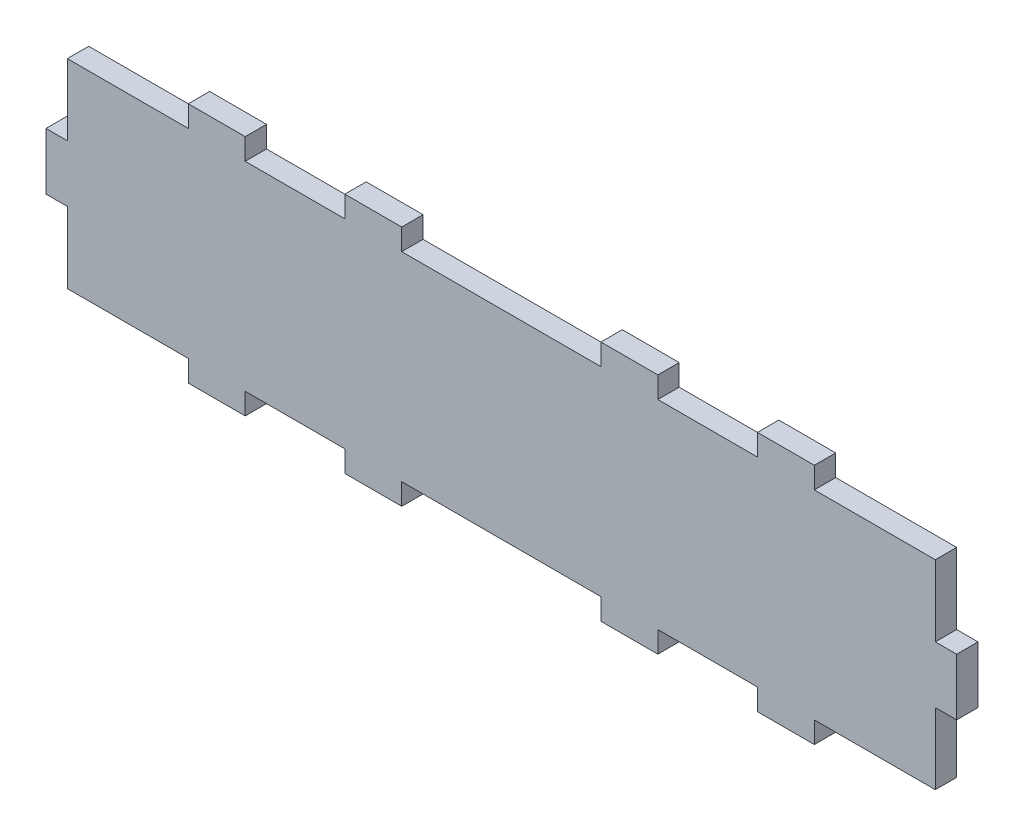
ISO-10303-21;
HEADER;
FILE_DESCRIPTION(('STEP AP214'),'2;1');
FILE_NAME('part.step','',(''),(''),'','','');
FILE_SCHEMA(('AUTOMOTIVE_DESIGN { 1 0 10303 214 1 1 1 1 }'));
ENDSEC;
DATA;
#1=APPLICATION_CONTEXT('core data for automotive mechanical design processes');
#2=APPLICATION_PROTOCOL_DEFINITION('international standard','automotive_design',2000,#1);
#3=PRODUCT_CONTEXT('',#1,'mechanical');
#4=PRODUCT('Part','Part','',(#3));
#5=PRODUCT_RELATED_PRODUCT_CATEGORY('part','',(#4));
#6=PRODUCT_DEFINITION_FORMATION('','',#4);
#7=PRODUCT_DEFINITION_CONTEXT('part definition',#1,'design');
#8=PRODUCT_DEFINITION('design','',#6,#7);
#9=PRODUCT_DEFINITION_SHAPE('','',#8);
#10=(LENGTH_UNIT() NAMED_UNIT(*) SI_UNIT(.MILLI.,.METRE.));
#11=(NAMED_UNIT(*) PLANE_ANGLE_UNIT() SI_UNIT($,.RADIAN.));
#12=(NAMED_UNIT(*) SI_UNIT($,.STERADIAN.) SOLID_ANGLE_UNIT());
#13=UNCERTAINTY_MEASURE_WITH_UNIT(LENGTH_MEASURE(1.E-05),#10,'distance_accuracy_value','');
#14=(GEOMETRIC_REPRESENTATION_CONTEXT(3) GLOBAL_UNCERTAINTY_ASSIGNED_CONTEXT((#13)) GLOBAL_UNIT_ASSIGNED_CONTEXT((#10,
#11,#12)) REPRESENTATION_CONTEXT('',''));
#15=CARTESIAN_POINT('',(0.,0.,0.));
#16=DIRECTION('',(0.,0.,1.));
#17=DIRECTION('',(1.,0.,0.));
#18=AXIS2_PLACEMENT_3D('',#15,#16,#17);
#19=CARTESIAN_POINT('',(0.,140.,15.));
#20=DIRECTION('',(0.,-1.,0.));
#21=DIRECTION('',(0.,0.,-1.));
#22=AXIS2_PLACEMENT_3D('',#19,#20,#21);
#23=PLANE('',#22);
#24=DIRECTION('',(0.,0.,1.));
#25=VECTOR('',#24,1.);
#26=CARTESIAN_POINT('',(85.,140.,15.));
#27=LINE('',#26,#25);
#28=CARTESIAN_POINT('',(85.,140.,0.));
#29=VERTEX_POINT('',#28);
#30=CARTESIAN_POINT('',(85.,140.,15.));
#31=VERTEX_POINT('',#30);
#32=EDGE_CURVE('E750',#29,#31,#27,.T.);
#33=ORIENTED_EDGE('',*,*,#32,.F.);
#34=DIRECTION('',(-1.,0.,0.));
#35=VECTOR('',#34,1.);
#36=CARTESIAN_POINT('',(0.,140.,0.));
#37=LINE('',#36,#35);
#38=CARTESIAN_POINT('',(0.,140.,0.));
#39=VERTEX_POINT('',#38);
#40=EDGE_CURVE('E351',#29,#39,#37,.T.);
#41=ORIENTED_EDGE('',*,*,#40,.T.);
#42=DIRECTION('',(0.,0.,-1.));
#43=VECTOR('',#42,1.);
#44=CARTESIAN_POINT('',(0.,140.,15.));
#45=LINE('',#44,#43);
#46=CARTESIAN_POINT('',(0.,140.,15.));
#47=VERTEX_POINT('',#46);
#48=EDGE_CURVE('E625',#47,#39,#45,.T.);
#49=ORIENTED_EDGE('',*,*,#48,.F.);
#50=DIRECTION('',(-1.,0.,0.));
#51=VECTOR('',#50,1.);
#52=CARTESIAN_POINT('',(0.,140.,15.));
#53=LINE('',#52,#51);
#54=EDGE_CURVE('E62',#31,#47,#53,.T.);
#55=ORIENTED_EDGE('',*,*,#54,.F.);
#56=EDGE_LOOP('',(#33,#41,#49,#55));
#57=FACE_BOUND('',#56,.T.);
#58=ADVANCED_FACE('F47',(#57),#23,.F.);
#59=DIRECTION('',(0.,0.,-1.));
#60=VECTOR('',#59,1.);
#61=CARTESIAN_POINT('',(125.,140.,15.));
#62=LINE('',#61,#60);
#63=CARTESIAN_POINT('',(125.,140.,15.));
#64=VERTEX_POINT('',#63);
#65=CARTESIAN_POINT('',(125.,140.,0.));
#66=VERTEX_POINT('',#65);
#67=EDGE_CURVE('E70',#64,#66,#62,.T.);
#68=ORIENTED_EDGE('',*,*,#67,.F.);
#69=CARTESIAN_POINT('',(195.,140.,15.));
#70=VERTEX_POINT('',#69);
#71=EDGE_CURVE('E759',#70,#64,#53,.T.);
#72=ORIENTED_EDGE('',*,*,#71,.F.);
#73=DIRECTION('',(0.,0.,1.));
#74=VECTOR('',#73,1.);
#75=CARTESIAN_POINT('',(195.,140.,15.));
#76=LINE('',#75,#74);
#77=CARTESIAN_POINT('',(195.,140.,0.));
#78=VERTEX_POINT('',#77);
#79=EDGE_CURVE('E352',#78,#70,#76,.T.);
#80=ORIENTED_EDGE('',*,*,#79,.F.);
#81=EDGE_CURVE('E747',#78,#66,#37,.T.);
#82=ORIENTED_EDGE('',*,*,#81,.T.);
#83=EDGE_LOOP('',(#68,#72,#80,#82));
#84=FACE_BOUND('',#83,.T.);
#85=ADVANCED_FACE('F721',(#84),#23,.F.);
#86=DIRECTION('',(0.,0.,-1.));
#87=VECTOR('',#86,1.);
#88=CARTESIAN_POINT('',(235.,140.,15.));
#89=LINE('',#88,#87);
#90=CARTESIAN_POINT('',(235.,140.,15.));
#91=VERTEX_POINT('',#90);
#92=CARTESIAN_POINT('',(235.,140.,0.));
#93=VERTEX_POINT('',#92);
#94=EDGE_CURVE('E355',#91,#93,#89,.T.);
#95=ORIENTED_EDGE('',*,*,#94,.F.);
#96=CARTESIAN_POINT('',(375.,140.,14.9999999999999));
#97=VERTEX_POINT('',#96);
#98=EDGE_CURVE('E627',#97,#91,#53,.T.);
#99=ORIENTED_EDGE('',*,*,#98,.F.);
#100=DIRECTION('',(0.,0.,1.));
#101=VECTOR('',#100,1.);
#102=CARTESIAN_POINT('',(375.,140.,15.));
#103=LINE('',#102,#101);
#104=CARTESIAN_POINT('',(375.,140.,0.));
#105=VERTEX_POINT('',#104);
#106=EDGE_CURVE('E411',#105,#97,#103,.T.);
#107=ORIENTED_EDGE('',*,*,#106,.F.);
#108=EDGE_CURVE('E642',#105,#93,#37,.T.);
#109=ORIENTED_EDGE('',*,*,#108,.T.);
#110=EDGE_LOOP('',(#95,#99,#107,#109));
#111=FACE_BOUND('',#110,.T.);
#112=ADVANCED_FACE('F727',(#111),#23,.F.);
#113=DIRECTION('',(0.,0.,1.));
#114=VECTOR('',#113,1.);
#115=CARTESIAN_POINT('',(485.,140.,15.));
#116=LINE('',#115,#114);
#117=CARTESIAN_POINT('',(485.,140.,0.));
#118=VERTEX_POINT('',#117);
#119=CARTESIAN_POINT('',(485.,140.,15.));
#120=VERTEX_POINT('',#119);
#121=EDGE_CURVE('E384',#118,#120,#116,.T.);
#122=ORIENTED_EDGE('',*,*,#121,.F.);
#123=CARTESIAN_POINT('',(415.,140.,0.));
#124=VERTEX_POINT('',#123);
#125=EDGE_CURVE('E641',#118,#124,#37,.T.);
#126=ORIENTED_EDGE('',*,*,#125,.T.);
#127=DIRECTION('',(0.,0.,-1.));
#128=VECTOR('',#127,1.);
#129=CARTESIAN_POINT('',(415.,140.,15.));
#130=LINE('',#129,#128);
#131=CARTESIAN_POINT('',(415.,140.,15.));
#132=VERTEX_POINT('',#131);
#133=EDGE_CURVE('E416',#132,#124,#130,.T.);
#134=ORIENTED_EDGE('',*,*,#133,.F.);
#135=EDGE_CURVE('E626',#120,#132,#53,.T.);
#136=ORIENTED_EDGE('',*,*,#135,.F.);
#137=EDGE_LOOP('',(#122,#126,#134,#136));
#138=FACE_BOUND('',#137,.T.);
#139=ADVANCED_FACE('F723',(#138),#23,.F.);
#140=DIRECTION('',(0.,0.,-1.));
#141=VECTOR('',#140,1.);
#142=CARTESIAN_POINT('',(525.,140.,15.0000000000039));
#143=LINE('',#142,#141);
#144=CARTESIAN_POINT('',(525.,140.,15.));
#145=VERTEX_POINT('',#144);
#146=CARTESIAN_POINT('',(525.,140.,0.));
#147=VERTEX_POINT('',#146);
#148=EDGE_CURVE('E389',#145,#147,#143,.T.);
#149=ORIENTED_EDGE('',*,*,#148,.F.);
#150=CARTESIAN_POINT('',(610.,140.,15.));
#151=VERTEX_POINT('',#150);
#152=EDGE_CURVE('E622',#151,#145,#53,.T.);
#153=ORIENTED_EDGE('',*,*,#152,.F.);
#154=DIRECTION('',(0.,0.,-1.));
#155=VECTOR('',#154,1.);
#156=CARTESIAN_POINT('',(610.,140.,15.));
#157=LINE('',#156,#155);
#158=CARTESIAN_POINT('',(610.,140.,0.));
#159=VERTEX_POINT('',#158);
#160=EDGE_CURVE('E645',#151,#159,#157,.T.);
#161=ORIENTED_EDGE('',*,*,#160,.T.);
#162=EDGE_CURVE('E639',#159,#147,#37,.T.);
#163=ORIENTED_EDGE('',*,*,#162,.T.);
#164=EDGE_LOOP('',(#149,#153,#161,#163));
#165=FACE_BOUND('',#164,.T.);
#166=ADVANCED_FACE('F730',(#165),#23,.F.);
#167=CARTESIAN_POINT('',(610.,0.,15.));
#168=DIRECTION('',(-1.,0.,0.));
#169=DIRECTION('',(0.,0.,1.));
#170=AXIS2_PLACEMENT_3D('',#167,#168,#169);
#171=PLANE('',#170);
#172=DIRECTION('',(0.,0.,-1.));
#173=VECTOR('',#172,1.);
#174=CARTESIAN_POINT('',(610.,50.,15.));
#175=LINE('',#174,#173);
#176=CARTESIAN_POINT('',(610.,50.,15.));
#177=VERTEX_POINT('',#176);
#178=CARTESIAN_POINT('',(610.,50.,0.));
#179=VERTEX_POINT('',#178);
#180=EDGE_CURVE('E443',#177,#179,#175,.T.);
#181=ORIENTED_EDGE('',*,*,#180,.F.);
#182=DIRECTION('',(0.,1.,0.));
#183=VECTOR('',#182,1.);
#184=CARTESIAN_POINT('',(610.,0.,15.));
#185=LINE('',#184,#183);
#186=CARTESIAN_POINT('',(610.,0.,15.));
#187=VERTEX_POINT('',#186);
#188=EDGE_CURVE('E619',#187,#177,#185,.T.);
#189=ORIENTED_EDGE('',*,*,#188,.F.);
#190=DIRECTION('',(0.,0.,-1.));
#191=VECTOR('',#190,1.);
#192=CARTESIAN_POINT('',(610.,0.,15.));
#193=LINE('',#192,#191);
#194=CARTESIAN_POINT('',(610.,0.,0.));
#195=VERTEX_POINT('',#194);
#196=EDGE_CURVE('E55',#187,#195,#193,.T.);
#197=ORIENTED_EDGE('',*,*,#196,.T.);
#198=DIRECTION('',(0.,1.,0.));
#199=VECTOR('',#198,1.);
#200=CARTESIAN_POINT('',(610.,0.,0.));
#201=LINE('',#200,#199);
#202=EDGE_CURVE('E637',#195,#179,#201,.T.);
#203=ORIENTED_EDGE('',*,*,#202,.T.);
#204=EDGE_LOOP('',(#181,#189,#197,#203));
#205=FACE_BOUND('',#204,.T.);
#206=ADVANCED_FACE('F652',(#205),#171,.F.);
#207=DIRECTION('',(0.,0.,1.));
#208=VECTOR('',#207,1.);
#209=CARTESIAN_POINT('',(610.,90.,14.9999999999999));
#210=LINE('',#209,#208);
#211=CARTESIAN_POINT('',(610.,90.,0.));
#212=VERTEX_POINT('',#211);
#213=CARTESIAN_POINT('',(610.,90.,15.));
#214=VERTEX_POINT('',#213);
#215=EDGE_CURVE('E438',#212,#214,#210,.T.);
#216=ORIENTED_EDGE('',*,*,#215,.F.);
#217=EDGE_CURVE('E634',#212,#159,#201,.T.);
#218=ORIENTED_EDGE('',*,*,#217,.T.);
#219=ORIENTED_EDGE('',*,*,#160,.F.);
#220=EDGE_CURVE('E616',#214,#151,#185,.T.);
#221=ORIENTED_EDGE('',*,*,#220,.F.);
#222=EDGE_LOOP('',(#216,#218,#219,#221));
#223=FACE_BOUND('',#222,.T.);
#224=ADVANCED_FACE('F1148',(#223),#171,.F.);
#225=CARTESIAN_POINT('',(0.,0.,15.));
#226=DIRECTION('',(1.,0.,0.));
#227=DIRECTION('',(0.,0.,-1.));
#228=AXIS2_PLACEMENT_3D('',#225,#226,#227);
#229=PLANE('',#228);
#230=DIRECTION('',(0.,-1.,0.));
#231=VECTOR('',#230,1.);
#232=CARTESIAN_POINT('',(0.,0.,0.));
#233=LINE('',#232,#231);
#234=CARTESIAN_POINT('',(0.,90.,0.));
#235=VERTEX_POINT('',#234);
#236=EDGE_CURVE('E628',#39,#235,#233,.T.);
#237=ORIENTED_EDGE('',*,*,#236,.T.);
#238=DIRECTION('',(0.,0.,1.));
#239=VECTOR('',#238,1.);
#240=CARTESIAN_POINT('',(0.,90.,15.));
#241=LINE('',#240,#239);
#242=CARTESIAN_POINT('',(0.,90.,15.));
#243=VERTEX_POINT('',#242);
#244=EDGE_CURVE('E465',#235,#243,#241,.T.);
#245=ORIENTED_EDGE('',*,*,#244,.T.);
#246=DIRECTION('',(0.,-1.,0.));
#247=VECTOR('',#246,1.);
#248=CARTESIAN_POINT('',(0.,0.,15.));
#249=LINE('',#248,#247);
#250=EDGE_CURVE('E608',#47,#243,#249,.T.);
#251=ORIENTED_EDGE('',*,*,#250,.F.);
#252=ORIENTED_EDGE('',*,*,#48,.T.);
#253=EDGE_LOOP('',(#237,#245,#251,#252));
#254=FACE_BOUND('',#253,.T.);
#255=ADVANCED_FACE('F752',(#254),#229,.F.);
#256=CARTESIAN_POINT('',(0.,0.,15.));
#257=DIRECTION('',(0.,1.,0.));
#258=DIRECTION('',(0.,0.,1.));
#259=AXIS2_PLACEMENT_3D('',#256,#257,#258);
#260=PLANE('',#259);
#261=DIRECTION('',(1.,0.,0.));
#262=VECTOR('',#261,1.);
#263=CARTESIAN_POINT('',(0.,0.,0.));
#264=LINE('',#263,#262);
#265=CARTESIAN_POINT('',(0.,0.,0.));
#266=VERTEX_POINT('',#265);
#267=CARTESIAN_POINT('',(85.,0.,0.));
#268=VERTEX_POINT('',#267);
#269=EDGE_CURVE('E632',#266,#268,#264,.T.);
#270=ORIENTED_EDGE('',*,*,#269,.T.);
#271=DIRECTION('',(0.,0.,1.));
#272=VECTOR('',#271,1.);
#273=CARTESIAN_POINT('',(85.,0.,0.));
#274=LINE('',#273,#272);
#275=CARTESIAN_POINT('',(85.,0.,15.));
#276=VERTEX_POINT('',#275);
#277=EDGE_CURVE('E507',#268,#276,#274,.T.);
#278=ORIENTED_EDGE('',*,*,#277,.T.);
#279=DIRECTION('',(1.,0.,0.));
#280=VECTOR('',#279,1.);
#281=CARTESIAN_POINT('',(0.,0.,15.));
#282=LINE('',#281,#280);
#283=CARTESIAN_POINT('',(0.,0.,15.));
#284=VERTEX_POINT('',#283);
#285=EDGE_CURVE('E613',#284,#276,#282,.T.);
#286=ORIENTED_EDGE('',*,*,#285,.F.);
#287=DIRECTION('',(0.,0.,-1.));
#288=VECTOR('',#287,1.);
#289=CARTESIAN_POINT('',(0.,0.,15.));
#290=LINE('',#289,#288);
#291=EDGE_CURVE('E11',#284,#266,#290,.T.);
#292=ORIENTED_EDGE('',*,*,#291,.T.);
#293=EDGE_LOOP('',(#270,#278,#286,#292));
#294=FACE_BOUND('',#293,.T.);
#295=ADVANCED_FACE('F718',(#294),#260,.F.);
#296=CARTESIAN_POINT('',(125.,0.,15.));
#297=VERTEX_POINT('',#296);
#298=CARTESIAN_POINT('',(195.,0.,15.));
#299=VERTEX_POINT('',#298);
#300=EDGE_CURVE('E617',#297,#299,#282,.T.);
#301=ORIENTED_EDGE('',*,*,#300,.F.);
#302=DIRECTION('',(0.,0.,-1.));
#303=VECTOR('',#302,1.);
#304=CARTESIAN_POINT('',(125.,0.,0.));
#305=LINE('',#304,#303);
#306=CARTESIAN_POINT('',(125.,0.,0.));
#307=VERTEX_POINT('',#306);
#308=EDGE_CURVE('E504',#297,#307,#305,.T.);
#309=ORIENTED_EDGE('',*,*,#308,.T.);
#310=CARTESIAN_POINT('',(195.,0.,0.));
#311=VERTEX_POINT('',#310);
#312=EDGE_CURVE('E635',#307,#311,#264,.T.);
#313=ORIENTED_EDGE('',*,*,#312,.T.);
#314=DIRECTION('',(0.,0.,1.));
#315=VECTOR('',#314,1.);
#316=CARTESIAN_POINT('',(195.,0.,0.));
#317=LINE('',#316,#315);
#318=EDGE_CURVE('E536',#311,#299,#317,.T.);
#319=ORIENTED_EDGE('',*,*,#318,.T.);
#320=EDGE_LOOP('',(#301,#309,#313,#319));
#321=FACE_BOUND('',#320,.T.);
#322=ADVANCED_FACE('F671',(#321),#260,.F.);
#323=CARTESIAN_POINT('',(415.,0.,0.));
#324=VERTEX_POINT('',#323);
#325=CARTESIAN_POINT('',(485.,0.,0.));
#326=VERTEX_POINT('',#325);
#327=EDGE_CURVE('E636',#324,#326,#264,.T.);
#328=ORIENTED_EDGE('',*,*,#327,.T.);
#329=DIRECTION('',(0.,0.,1.));
#330=VECTOR('',#329,1.);
#331=CARTESIAN_POINT('',(485.,0.,0.));
#332=LINE('',#331,#330);
#333=CARTESIAN_POINT('',(485.,0.,15.));
#334=VERTEX_POINT('',#333);
#335=EDGE_CURVE('E566',#326,#334,#332,.T.);
#336=ORIENTED_EDGE('',*,*,#335,.T.);
#337=CARTESIAN_POINT('',(415.,0.,14.9999999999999));
#338=VERTEX_POINT('',#337);
#339=EDGE_CURVE('E618',#338,#334,#282,.T.);
#340=ORIENTED_EDGE('',*,*,#339,.F.);
#341=DIRECTION('',(0.,0.,-1.));
#342=VECTOR('',#341,1.);
#343=CARTESIAN_POINT('',(415.,0.,0.));
#344=LINE('',#343,#342);
#345=EDGE_CURVE('E584',#338,#324,#344,.T.);
#346=ORIENTED_EDGE('',*,*,#345,.T.);
#347=EDGE_LOOP('',(#328,#336,#340,#346));
#348=FACE_BOUND('',#347,.T.);
#349=ADVANCED_FACE('F712',(#348),#260,.F.);
#350=CARTESIAN_POINT('',(235.,0.,15.));
#351=VERTEX_POINT('',#350);
#352=CARTESIAN_POINT('',(375.,0.,14.9999999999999));
#353=VERTEX_POINT('',#352);
#354=EDGE_CURVE('E665',#351,#353,#282,.T.);
#355=ORIENTED_EDGE('',*,*,#354,.F.);
#356=DIRECTION('',(0.,0.,-1.));
#357=VECTOR('',#356,1.);
#358=CARTESIAN_POINT('',(235.,0.,0.));
#359=LINE('',#358,#357);
#360=CARTESIAN_POINT('',(235.,0.,0.));
#361=VERTEX_POINT('',#360);
#362=EDGE_CURVE('E533',#351,#361,#359,.T.);
#363=ORIENTED_EDGE('',*,*,#362,.T.);
#364=CARTESIAN_POINT('',(375.,0.,0.));
#365=VERTEX_POINT('',#364);
#366=EDGE_CURVE('E679',#361,#365,#264,.T.);
#367=ORIENTED_EDGE('',*,*,#366,.T.);
#368=DIRECTION('',(0.,0.,1.));
#369=VECTOR('',#368,1.);
#370=CARTESIAN_POINT('',(375.,0.,0.));
#371=LINE('',#370,#369);
#372=EDGE_CURVE('E569',#365,#353,#371,.T.);
#373=ORIENTED_EDGE('',*,*,#372,.T.);
#374=EDGE_LOOP('',(#355,#363,#367,#373));
#375=FACE_BOUND('',#374,.T.);
#376=ADVANCED_FACE('F684',(#375),#260,.F.);
#377=CARTESIAN_POINT('',(0.,50.,15.));
#378=VERTEX_POINT('',#377);
#379=EDGE_CURVE('E612',#378,#284,#249,.T.);
#380=ORIENTED_EDGE('',*,*,#379,.F.);
#381=DIRECTION('',(0.,0.,-1.));
#382=VECTOR('',#381,1.);
#383=CARTESIAN_POINT('',(0.,50.,15.));
#384=LINE('',#383,#382);
#385=CARTESIAN_POINT('',(0.,50.,0.));
#386=VERTEX_POINT('',#385);
#387=EDGE_CURVE('E470',#378,#386,#384,.T.);
#388=ORIENTED_EDGE('',*,*,#387,.T.);
#389=EDGE_CURVE('E601',#386,#266,#233,.T.);
#390=ORIENTED_EDGE('',*,*,#389,.T.);
#391=ORIENTED_EDGE('',*,*,#291,.F.);
#392=EDGE_LOOP('',(#380,#388,#390,#391));
#393=FACE_BOUND('',#392,.T.);
#394=ADVANCED_FACE('F49',(#393),#229,.F.);
#395=CARTESIAN_POINT('',(525.,0.,15.));
#396=VERTEX_POINT('',#395);
#397=EDGE_CURVE('E611',#396,#187,#282,.T.);
#398=ORIENTED_EDGE('',*,*,#397,.F.);
#399=DIRECTION('',(0.,0.,-1.));
#400=VECTOR('',#399,1.);
#401=CARTESIAN_POINT('',(525.,0.,0.));
#402=LINE('',#401,#400);
#403=CARTESIAN_POINT('',(525.,0.,0.));
#404=VERTEX_POINT('',#403);
#405=EDGE_CURVE('E563',#396,#404,#402,.T.);
#406=ORIENTED_EDGE('',*,*,#405,.T.);
#407=EDGE_CURVE('E631',#404,#195,#264,.T.);
#408=ORIENTED_EDGE('',*,*,#407,.T.);
#409=ORIENTED_EDGE('',*,*,#196,.F.);
#410=EDGE_LOOP('',(#398,#406,#408,#409));
#411=FACE_BOUND('',#410,.T.);
#412=ADVANCED_FACE('F711',(#411),#260,.F.);
#413=CARTESIAN_POINT('',(0.,0.,15.));
#414=DIRECTION('',(0.,0.,-1.));
#415=DIRECTION('',(-1.,0.,0.));
#416=AXIS2_PLACEMENT_3D('',#413,#414,#415);
#417=PLANE('',#416);
#418=ORIENTED_EDGE('',*,*,#250,.T.);
#419=DIRECTION('',(1.,0.,0.));
#420=VECTOR('',#419,1.);
#421=CARTESIAN_POINT('',(-15.,90.,15.));
#422=LINE('',#421,#420);
#423=CARTESIAN_POINT('',(-15.,90.,15.));
#424=VERTEX_POINT('',#423);
#425=EDGE_CURVE('E489',#424,#243,#422,.T.);
#426=ORIENTED_EDGE('',*,*,#425,.F.);
#427=DIRECTION('',(0.,-1.,0.));
#428=VECTOR('',#427,1.);
#429=CARTESIAN_POINT('',(-15.,90.,15.));
#430=LINE('',#429,#428);
#431=CARTESIAN_POINT('',(-15.,50.,15.));
#432=VERTEX_POINT('',#431);
#433=EDGE_CURVE('E473',#424,#432,#430,.T.);
#434=ORIENTED_EDGE('',*,*,#433,.T.);
#435=DIRECTION('',(1.,0.,0.));
#436=VECTOR('',#435,1.);
#437=CARTESIAN_POINT('',(-15.,50.,15.));
#438=LINE('',#437,#436);
#439=EDGE_CURVE('E487',#432,#378,#438,.T.);
#440=ORIENTED_EDGE('',*,*,#439,.T.);
#441=ORIENTED_EDGE('',*,*,#379,.T.);
#442=ORIENTED_EDGE('',*,*,#285,.T.);
#443=DIRECTION('',(0.,1.,0.));
#444=VECTOR('',#443,1.);
#445=CARTESIAN_POINT('',(85.,-15.,15.));
#446=LINE('',#445,#444);
#447=CARTESIAN_POINT('',(85.,-15.,15.));
#448=VERTEX_POINT('',#447);
#449=EDGE_CURVE('E492',#448,#276,#446,.T.);
#450=ORIENTED_EDGE('',*,*,#449,.F.);
#451=DIRECTION('',(1.,0.,0.));
#452=VECTOR('',#451,1.);
#453=CARTESIAN_POINT('',(85.,-15.,15.));
#454=LINE('',#453,#452);
#455=CARTESIAN_POINT('',(125.,-15.,15.));
#456=VERTEX_POINT('',#455);
#457=EDGE_CURVE('E516',#448,#456,#454,.T.);
#458=ORIENTED_EDGE('',*,*,#457,.T.);
#459=DIRECTION('',(0.,1.,0.));
#460=VECTOR('',#459,1.);
#461=CARTESIAN_POINT('',(125.,-15.,15.));
#462=LINE('',#461,#460);
#463=EDGE_CURVE('E496',#456,#297,#462,.T.);
#464=ORIENTED_EDGE('',*,*,#463,.T.);
#465=ORIENTED_EDGE('',*,*,#300,.T.);
#466=DIRECTION('',(0.,1.,0.));
#467=VECTOR('',#466,1.);
#468=CARTESIAN_POINT('',(195.,-15.,15.));
#469=LINE('',#468,#467);
#470=CARTESIAN_POINT('',(195.,-15.,15.));
#471=VERTEX_POINT('',#470);
#472=EDGE_CURVE('E521',#471,#299,#469,.T.);
#473=ORIENTED_EDGE('',*,*,#472,.F.);
#474=DIRECTION('',(1.,0.,0.));
#475=VECTOR('',#474,1.);
#476=CARTESIAN_POINT('',(195.,-15.,15.));
#477=LINE('',#476,#475);
#478=CARTESIAN_POINT('',(235.,-15.,15.));
#479=VERTEX_POINT('',#478);
#480=EDGE_CURVE('E546',#471,#479,#477,.T.);
#481=ORIENTED_EDGE('',*,*,#480,.T.);
#482=DIRECTION('',(0.,1.,0.));
#483=VECTOR('',#482,1.);
#484=CARTESIAN_POINT('',(235.,-15.,15.));
#485=LINE('',#484,#483);
#486=EDGE_CURVE('E525',#479,#351,#485,.T.);
#487=ORIENTED_EDGE('',*,*,#486,.T.);
#488=ORIENTED_EDGE('',*,*,#354,.T.);
#489=DIRECTION('',(0.,1.,0.));
#490=VECTOR('',#489,1.);
#491=CARTESIAN_POINT('',(375.,-15.,14.9999999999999));
#492=LINE('',#491,#490);
#493=CARTESIAN_POINT('',(375.,-15.,14.9999999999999));
#494=VERTEX_POINT('',#493);
#495=EDGE_CURVE('E593',#494,#353,#492,.T.);
#496=ORIENTED_EDGE('',*,*,#495,.F.);
#497=DIRECTION('',(1.,0.,0.));
#498=VECTOR('',#497,1.);
#499=CARTESIAN_POINT('',(375.,-15.,14.9999999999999));
#500=LINE('',#499,#498);
#501=CARTESIAN_POINT('',(415.,-15.,14.9999999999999));
#502=VERTEX_POINT('',#501);
#503=EDGE_CURVE('E583',#494,#502,#500,.T.);
#504=ORIENTED_EDGE('',*,*,#503,.T.);
#505=DIRECTION('',(0.,1.,0.));
#506=VECTOR('',#505,1.);
#507=CARTESIAN_POINT('',(415.,-15.,14.9999999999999));
#508=LINE('',#507,#506);
#509=EDGE_CURVE('E604',#502,#338,#508,.T.);
#510=ORIENTED_EDGE('',*,*,#509,.T.);
#511=ORIENTED_EDGE('',*,*,#339,.T.);
#512=DIRECTION('',(0.,1.,0.));
#513=VECTOR('',#512,1.);
#514=CARTESIAN_POINT('',(485.,-15.,14.9999999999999));
#515=LINE('',#514,#513);
#516=CARTESIAN_POINT('',(485.,-15.,14.9999999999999));
#517=VERTEX_POINT('',#516);
#518=EDGE_CURVE('E551',#517,#334,#515,.T.);
#519=ORIENTED_EDGE('',*,*,#518,.F.);
#520=DIRECTION('',(1.,0.,0.));
#521=VECTOR('',#520,1.);
#522=CARTESIAN_POINT('',(485.,-15.,14.9999999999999));
#523=LINE('',#522,#521);
#524=CARTESIAN_POINT('',(525.,-15.,14.9999999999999));
#525=VERTEX_POINT('',#524);
#526=EDGE_CURVE('E575',#517,#525,#523,.T.);
#527=ORIENTED_EDGE('',*,*,#526,.T.);
#528=DIRECTION('',(0.,1.,0.));
#529=VECTOR('',#528,1.);
#530=CARTESIAN_POINT('',(525.,-15.,14.9999999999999));
#531=LINE('',#530,#529);
#532=EDGE_CURVE('E555',#525,#396,#531,.T.);
#533=ORIENTED_EDGE('',*,*,#532,.T.);
#534=ORIENTED_EDGE('',*,*,#397,.T.);
#535=ORIENTED_EDGE('',*,*,#188,.T.);
#536=DIRECTION('',(-1.,0.,0.));
#537=VECTOR('',#536,1.);
#538=CARTESIAN_POINT('',(625.,50.,15.));
#539=LINE('',#538,#537);
#540=CARTESIAN_POINT('',(625.,50.,15.));
#541=VERTEX_POINT('',#540);
#542=EDGE_CURVE('E456',#541,#177,#539,.T.);
#543=ORIENTED_EDGE('',*,*,#542,.F.);
#544=DIRECTION('',(0.,-1.,0.));
#545=VECTOR('',#544,1.);
#546=CARTESIAN_POINT('',(625.,0.,15.));
#547=LINE('',#546,#545);
#548=CARTESIAN_POINT('',(625.,90.,15.));
#549=VERTEX_POINT('',#548);
#550=EDGE_CURVE('E445',#549,#541,#547,.T.);
#551=ORIENTED_EDGE('',*,*,#550,.F.);
#552=DIRECTION('',(-1.,0.,0.));
#553=VECTOR('',#552,1.);
#554=CARTESIAN_POINT('',(625.,90.,15.));
#555=LINE('',#554,#553);
#556=EDGE_CURVE('E459',#549,#214,#555,.T.);
#557=ORIENTED_EDGE('',*,*,#556,.T.);
#558=ORIENTED_EDGE('',*,*,#220,.T.);
#559=ORIENTED_EDGE('',*,*,#152,.T.);
#560=DIRECTION('',(0.,-1.,0.));
#561=VECTOR('',#560,1.);
#562=CARTESIAN_POINT('',(525.,155.,14.9999999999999));
#563=LINE('',#562,#561);
#564=CARTESIAN_POINT('',(525.,155.,14.9999999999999));
#565=VERTEX_POINT('',#564);
#566=EDGE_CURVE('E402',#565,#145,#563,.T.);
#567=ORIENTED_EDGE('',*,*,#566,.F.);
#568=DIRECTION('',(1.,0.,0.));
#569=VECTOR('',#568,1.);
#570=CARTESIAN_POINT('',(0.,155.,14.9999999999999));
#571=LINE('',#570,#569);
#572=CARTESIAN_POINT('',(485.,155.,14.9999999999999));
#573=VERTEX_POINT('',#572);
#574=EDGE_CURVE('E391',#573,#565,#571,.T.);
#575=ORIENTED_EDGE('',*,*,#574,.F.);
#576=DIRECTION('',(0.,-1.,0.));
#577=VECTOR('',#576,1.);
#578=CARTESIAN_POINT('',(485.,155.,14.9999999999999));
#579=LINE('',#578,#577);
#580=EDGE_CURVE('E405',#573,#120,#579,.T.);
#581=ORIENTED_EDGE('',*,*,#580,.T.);
#582=ORIENTED_EDGE('',*,*,#135,.T.);
#583=DIRECTION('',(0.,-1.,0.));
#584=VECTOR('',#583,1.);
#585=CARTESIAN_POINT('',(415.,155.,14.9999999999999));
#586=LINE('',#585,#584);
#587=CARTESIAN_POINT('',(415.,155.,14.9999999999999));
#588=VERTEX_POINT('',#587);
#589=EDGE_CURVE('E429',#588,#132,#586,.T.);
#590=ORIENTED_EDGE('',*,*,#589,.F.);
#591=DIRECTION('',(1.,0.,0.));
#592=VECTOR('',#591,1.);
#593=CARTESIAN_POINT('',(0.,155.,14.9999999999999));
#594=LINE('',#593,#592);
#595=CARTESIAN_POINT('',(375.,155.,14.9999999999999));
#596=VERTEX_POINT('',#595);
#597=EDGE_CURVE('E418',#596,#588,#594,.T.);
#598=ORIENTED_EDGE('',*,*,#597,.F.);
#599=DIRECTION('',(0.,-1.,0.));
#600=VECTOR('',#599,1.);
#601=CARTESIAN_POINT('',(375.,155.,14.9999999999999));
#602=LINE('',#601,#600);
#603=EDGE_CURVE('E432',#596,#97,#602,.T.);
#604=ORIENTED_EDGE('',*,*,#603,.T.);
#605=ORIENTED_EDGE('',*,*,#98,.T.);
#606=DIRECTION('',(0.,-1.,0.));
#607=VECTOR('',#606,1.);
#608=CARTESIAN_POINT('',(235.,155.,15.));
#609=LINE('',#608,#607);
#610=CARTESIAN_POINT('',(235.,155.,15.));
#611=VERTEX_POINT('',#610);
#612=EDGE_CURVE('E375',#611,#91,#609,.T.);
#613=ORIENTED_EDGE('',*,*,#612,.F.);
#614=DIRECTION('',(1.,0.,0.));
#615=VECTOR('',#614,1.);
#616=CARTESIAN_POINT('',(0.,155.,15.));
#617=LINE('',#616,#615);
#618=CARTESIAN_POINT('',(195.,155.,15.));
#619=VERTEX_POINT('',#618);
#620=EDGE_CURVE('E366',#619,#611,#617,.T.);
#621=ORIENTED_EDGE('',*,*,#620,.F.);
#622=DIRECTION('',(0.,-1.,0.));
#623=VECTOR('',#622,1.);
#624=CARTESIAN_POINT('',(195.,155.,15.));
#625=LINE('',#624,#623);
#626=EDGE_CURVE('E378',#619,#70,#625,.T.);
#627=ORIENTED_EDGE('',*,*,#626,.T.);
#628=ORIENTED_EDGE('',*,*,#71,.T.);
#629=DIRECTION('',(0.,-1.,0.));
#630=VECTOR('',#629,1.);
#631=CARTESIAN_POINT('',(125.,155.,15.));
#632=LINE('',#631,#630);
#633=CARTESIAN_POINT('',(125.,155.,15.));
#634=VERTEX_POINT('',#633);
#635=EDGE_CURVE('E357',#634,#64,#632,.T.);
#636=ORIENTED_EDGE('',*,*,#635,.F.);
#637=DIRECTION('',(1.,0.,0.));
#638=VECTOR('',#637,1.);
#639=CARTESIAN_POINT('',(0.,155.,15.));
#640=LINE('',#639,#638);
#641=CARTESIAN_POINT('',(85.,155.,15.));
#642=VERTEX_POINT('',#641);
#643=EDGE_CURVE('E338',#642,#634,#640,.T.);
#644=ORIENTED_EDGE('',*,*,#643,.F.);
#645=DIRECTION('',(0.,-1.,0.));
#646=VECTOR('',#645,1.);
#647=CARTESIAN_POINT('',(85.,155.,15.));
#648=LINE('',#647,#646);
#649=EDGE_CURVE('E335',#642,#31,#648,.T.);
#650=ORIENTED_EDGE('',*,*,#649,.T.);
#651=ORIENTED_EDGE('',*,*,#54,.T.);
#652=EDGE_LOOP('',(#418,#426,#434,#440,#441,#442,#450,#458,#464,#465,#473,#481,#487,#488,#496,
#504,#510,#511,#519,#527,#533,#534,#535,#543,#551,#557,#558,#559,#567,#575,#581,#582,#590,#598,
#604,#605,#613,#621,#627,#628,#636,#644,#650,#651));
#653=FACE_BOUND('',#652,.T.);
#654=ADVANCED_FACE('F662',(#653),#417,.F.);
#655=CARTESIAN_POINT('',(0.,0.,0.));
#656=DIRECTION('',(0.,0.,-1.));
#657=DIRECTION('',(-1.,0.,0.));
#658=AXIS2_PLACEMENT_3D('',#655,#656,#657);
#659=PLANE('',#658);
#660=ORIENTED_EDGE('',*,*,#236,.F.);
#661=ORIENTED_EDGE('',*,*,#40,.F.);
#662=DIRECTION('',(0.,-1.,0.));
#663=VECTOR('',#662,1.);
#664=CARTESIAN_POINT('',(85.,155.,0.));
#665=LINE('',#664,#663);
#666=CARTESIAN_POINT('',(85.,155.,0.));
#667=VERTEX_POINT('',#666);
#668=EDGE_CURVE('E333',#667,#29,#665,.T.);
#669=ORIENTED_EDGE('',*,*,#668,.F.);
#670=DIRECTION('',(-1.,0.,0.));
#671=VECTOR('',#670,1.);
#672=CARTESIAN_POINT('',(0.,155.,0.));
#673=LINE('',#672,#671);
#674=CARTESIAN_POINT('',(125.,155.,0.));
#675=VERTEX_POINT('',#674);
#676=EDGE_CURVE('E339',#675,#667,#673,.T.);
#677=ORIENTED_EDGE('',*,*,#676,.F.);
#678=DIRECTION('',(0.,-1.,0.));
#679=VECTOR('',#678,1.);
#680=CARTESIAN_POINT('',(125.,155.,0.));
#681=LINE('',#680,#679);
#682=EDGE_CURVE('E789',#675,#66,#681,.T.);
#683=ORIENTED_EDGE('',*,*,#682,.T.);
#684=ORIENTED_EDGE('',*,*,#81,.F.);
#685=DIRECTION('',(0.,-1.,0.));
#686=VECTOR('',#685,1.);
#687=CARTESIAN_POINT('',(195.,155.,0.));
#688=LINE('',#687,#686);
#689=CARTESIAN_POINT('',(195.,155.,0.));
#690=VERTEX_POINT('',#689);
#691=EDGE_CURVE('E381',#690,#78,#688,.T.);
#692=ORIENTED_EDGE('',*,*,#691,.F.);
#693=DIRECTION('',(-1.,0.,0.));
#694=VECTOR('',#693,1.);
#695=CARTESIAN_POINT('',(0.,155.,0.));
#696=LINE('',#695,#694);
#697=CARTESIAN_POINT('',(235.,155.,0.));
#698=VERTEX_POINT('',#697);
#699=EDGE_CURVE('E361',#698,#690,#696,.T.);
#700=ORIENTED_EDGE('',*,*,#699,.F.);
#701=DIRECTION('',(0.,-1.,0.));
#702=VECTOR('',#701,1.);
#703=CARTESIAN_POINT('',(235.,155.,0.));
#704=LINE('',#703,#702);
#705=EDGE_CURVE('E369',#698,#93,#704,.T.);
#706=ORIENTED_EDGE('',*,*,#705,.T.);
#707=ORIENTED_EDGE('',*,*,#108,.F.);
#708=DIRECTION('',(0.,-1.,0.));
#709=VECTOR('',#708,1.);
#710=CARTESIAN_POINT('',(375.,155.,0.));
#711=LINE('',#710,#709);
#712=CARTESIAN_POINT('',(375.,155.,0.));
#713=VERTEX_POINT('',#712);
#714=EDGE_CURVE('E435',#713,#105,#711,.T.);
#715=ORIENTED_EDGE('',*,*,#714,.F.);
#716=DIRECTION('',(-1.,0.,0.));
#717=VECTOR('',#716,1.);
#718=CARTESIAN_POINT('',(0.,155.,0.));
#719=LINE('',#718,#717);
#720=CARTESIAN_POINT('',(415.,155.,0.));
#721=VERTEX_POINT('',#720);
#722=EDGE_CURVE('E412',#721,#713,#719,.T.);
#723=ORIENTED_EDGE('',*,*,#722,.F.);
#724=DIRECTION('',(0.,-1.,0.));
#725=VECTOR('',#724,1.);
#726=CARTESIAN_POINT('',(415.,155.,0.));
#727=LINE('',#726,#725);
#728=EDGE_CURVE('E422',#721,#124,#727,.T.);
#729=ORIENTED_EDGE('',*,*,#728,.T.);
#730=ORIENTED_EDGE('',*,*,#125,.F.);
#731=DIRECTION('',(0.,-1.,0.));
#732=VECTOR('',#731,1.);
#733=CARTESIAN_POINT('',(485.,155.,0.));
#734=LINE('',#733,#732);
#735=CARTESIAN_POINT('',(485.,155.,0.));
#736=VERTEX_POINT('',#735);
#737=EDGE_CURVE('E408',#736,#118,#734,.T.);
#738=ORIENTED_EDGE('',*,*,#737,.F.);
#739=DIRECTION('',(-1.,0.,0.));
#740=VECTOR('',#739,1.);
#741=CARTESIAN_POINT('',(0.,155.,0.));
#742=LINE('',#741,#740);
#743=CARTESIAN_POINT('',(525.,155.,0.));
#744=VERTEX_POINT('',#743);
#745=EDGE_CURVE('E385',#744,#736,#742,.T.);
#746=ORIENTED_EDGE('',*,*,#745,.F.);
#747=DIRECTION('',(0.,-1.,0.));
#748=VECTOR('',#747,1.);
#749=CARTESIAN_POINT('',(525.,155.,0.));
#750=LINE('',#749,#748);
#751=EDGE_CURVE('E395',#744,#147,#750,.T.);
#752=ORIENTED_EDGE('',*,*,#751,.T.);
#753=ORIENTED_EDGE('',*,*,#162,.F.);
#754=ORIENTED_EDGE('',*,*,#217,.F.);
#755=DIRECTION('',(-1.,0.,0.));
#756=VECTOR('',#755,1.);
#757=CARTESIAN_POINT('',(625.,90.,0.));
#758=LINE('',#757,#756);
#759=CARTESIAN_POINT('',(625.,90.,0.));
#760=VERTEX_POINT('',#759);
#761=EDGE_CURVE('E462',#760,#212,#758,.T.);
#762=ORIENTED_EDGE('',*,*,#761,.F.);
#763=DIRECTION('',(0.,1.,0.));
#764=VECTOR('',#763,1.);
#765=CARTESIAN_POINT('',(625.,0.,0.));
#766=LINE('',#765,#764);
#767=CARTESIAN_POINT('',(625.,50.,0.));
#768=VERTEX_POINT('',#767);
#769=EDGE_CURVE('E439',#768,#760,#766,.T.);
#770=ORIENTED_EDGE('',*,*,#769,.F.);
#771=DIRECTION('',(-1.,0.,0.));
#772=VECTOR('',#771,1.);
#773=CARTESIAN_POINT('',(625.,50.,0.));
#774=LINE('',#773,#772);
#775=EDGE_CURVE('E449',#768,#179,#774,.T.);
#776=ORIENTED_EDGE('',*,*,#775,.T.);
#777=ORIENTED_EDGE('',*,*,#202,.F.);
#778=ORIENTED_EDGE('',*,*,#407,.F.);
#779=DIRECTION('',(0.,1.,0.));
#780=VECTOR('',#779,1.);
#781=CARTESIAN_POINT('',(525.,-15.,0.));
#782=LINE('',#781,#780);
#783=CARTESIAN_POINT('',(525.,-15.,0.));
#784=VERTEX_POINT('',#783);
#785=EDGE_CURVE('E558',#784,#404,#782,.T.);
#786=ORIENTED_EDGE('',*,*,#785,.F.);
#787=DIRECTION('',(-1.,0.,0.));
#788=VECTOR('',#787,1.);
#789=CARTESIAN_POINT('',(485.,-15.,0.));
#790=LINE('',#789,#788);
#791=CARTESIAN_POINT('',(485.,-15.,0.));
#792=VERTEX_POINT('',#791);
#793=EDGE_CURVE('E554',#784,#792,#790,.T.);
#794=ORIENTED_EDGE('',*,*,#793,.T.);
#795=DIRECTION('',(0.,1.,0.));
#796=VECTOR('',#795,1.);
#797=CARTESIAN_POINT('',(485.,-15.,0.));
#798=LINE('',#797,#796);
#799=EDGE_CURVE('E540',#792,#326,#798,.T.);
#800=ORIENTED_EDGE('',*,*,#799,.T.);
#801=ORIENTED_EDGE('',*,*,#327,.F.);
#802=DIRECTION('',(0.,1.,0.));
#803=VECTOR('',#802,1.);
#804=CARTESIAN_POINT('',(415.,-15.,0.));
#805=LINE('',#804,#803);
#806=CARTESIAN_POINT('',(415.,-15.,0.));
#807=VERTEX_POINT('',#806);
#808=EDGE_CURVE('E602',#807,#324,#805,.T.);
#809=ORIENTED_EDGE('',*,*,#808,.F.);
#810=DIRECTION('',(-1.,0.,0.));
#811=VECTOR('',#810,1.);
#812=CARTESIAN_POINT('',(375.,-15.,0.));
#813=LINE('',#812,#811);
#814=CARTESIAN_POINT('',(375.,-15.,0.));
#815=VERTEX_POINT('',#814);
#816=EDGE_CURVE('E590',#807,#815,#813,.T.);
#817=ORIENTED_EDGE('',*,*,#816,.T.);
#818=DIRECTION('',(0.,1.,0.));
#819=VECTOR('',#818,1.);
#820=CARTESIAN_POINT('',(375.,-15.,0.));
#821=LINE('',#820,#819);
#822=EDGE_CURVE('E598',#815,#365,#821,.T.);
#823=ORIENTED_EDGE('',*,*,#822,.T.);
#824=ORIENTED_EDGE('',*,*,#366,.F.);
#825=DIRECTION('',(0.,1.,0.));
#826=VECTOR('',#825,1.);
#827=CARTESIAN_POINT('',(235.,-15.,0.));
#828=LINE('',#827,#826);
#829=CARTESIAN_POINT('',(235.,-15.,0.));
#830=VERTEX_POINT('',#829);
#831=EDGE_CURVE('E528',#830,#361,#828,.T.);
#832=ORIENTED_EDGE('',*,*,#831,.F.);
#833=DIRECTION('',(-1.,0.,0.));
#834=VECTOR('',#833,1.);
#835=CARTESIAN_POINT('',(195.,-15.,0.));
#836=LINE('',#835,#834);
#837=CARTESIAN_POINT('',(195.,-15.,0.));
#838=VERTEX_POINT('',#837);
#839=EDGE_CURVE('E524',#830,#838,#836,.T.);
#840=ORIENTED_EDGE('',*,*,#839,.T.);
#841=DIRECTION('',(0.,1.,0.));
#842=VECTOR('',#841,1.);
#843=CARTESIAN_POINT('',(195.,-15.,0.));
#844=LINE('',#843,#842);
#845=EDGE_CURVE('E510',#838,#311,#844,.T.);
#846=ORIENTED_EDGE('',*,*,#845,.T.);
#847=ORIENTED_EDGE('',*,*,#312,.F.);
#848=DIRECTION('',(0.,1.,0.));
#849=VECTOR('',#848,1.);
#850=CARTESIAN_POINT('',(125.,-15.,0.));
#851=LINE('',#850,#849);
#852=CARTESIAN_POINT('',(125.,-15.,0.));
#853=VERTEX_POINT('',#852);
#854=EDGE_CURVE('E499',#853,#307,#851,.T.);
#855=ORIENTED_EDGE('',*,*,#854,.F.);
#856=DIRECTION('',(-1.,0.,0.));
#857=VECTOR('',#856,1.);
#858=CARTESIAN_POINT('',(85.,-15.,0.));
#859=LINE('',#858,#857);
#860=CARTESIAN_POINT('',(85.,-15.,0.));
#861=VERTEX_POINT('',#860);
#862=EDGE_CURVE('E495',#853,#861,#859,.T.);
#863=ORIENTED_EDGE('',*,*,#862,.T.);
#864=DIRECTION('',(0.,1.,0.));
#865=VECTOR('',#864,1.);
#866=CARTESIAN_POINT('',(85.,-15.,0.));
#867=LINE('',#866,#865);
#868=EDGE_CURVE('E486',#861,#268,#867,.T.);
#869=ORIENTED_EDGE('',*,*,#868,.T.);
#870=ORIENTED_EDGE('',*,*,#269,.F.);
#871=ORIENTED_EDGE('',*,*,#389,.F.);
#872=DIRECTION('',(1.,0.,0.));
#873=VECTOR('',#872,1.);
#874=CARTESIAN_POINT('',(-15.,50.,0.));
#875=LINE('',#874,#873);
#876=CARTESIAN_POINT('',(-15.,50.,0.));
#877=VERTEX_POINT('',#876);
#878=EDGE_CURVE('E484',#877,#386,#875,.T.);
#879=ORIENTED_EDGE('',*,*,#878,.F.);
#880=DIRECTION('',(0.,1.,0.));
#881=VECTOR('',#880,1.);
#882=CARTESIAN_POINT('',(-15.,90.,0.));
#883=LINE('',#882,#881);
#884=CARTESIAN_POINT('',(-15.,90.,0.));
#885=VERTEX_POINT('',#884);
#886=EDGE_CURVE('E466',#877,#885,#883,.T.);
#887=ORIENTED_EDGE('',*,*,#886,.T.);
#888=DIRECTION('',(1.,0.,0.));
#889=VECTOR('',#888,1.);
#890=CARTESIAN_POINT('',(-15.,90.,0.));
#891=LINE('',#890,#889);
#892=EDGE_CURVE('E479',#885,#235,#891,.T.);
#893=ORIENTED_EDGE('',*,*,#892,.T.);
#894=EDGE_LOOP('',(#660,#661,#669,#677,#683,#684,#692,#700,#706,#707,#715,#723,#729,#730,#738,
#746,#752,#753,#754,#762,#770,#776,#777,#778,#786,#794,#800,#801,#809,#817,#823,#824,#832,#840,
#846,#847,#855,#863,#869,#870,#871,#879,#887,#893));
#895=FACE_BOUND('',#894,.T.);
#896=ADVANCED_FACE('F350',(#895),#659,.T.);
#897=CARTESIAN_POINT('',(375.,-15.,0.));
#898=DIRECTION('',(-1.,0.,0.));
#899=DIRECTION('',(0.,0.,1.));
#900=AXIS2_PLACEMENT_3D('',#897,#898,#899);
#901=PLANE('',#900);
#902=ORIENTED_EDGE('',*,*,#372,.F.);
#903=ORIENTED_EDGE('',*,*,#822,.F.);
#904=DIRECTION('',(0.,0.,1.));
#905=VECTOR('',#904,1.);
#906=CARTESIAN_POINT('',(375.,-15.,0.));
#907=LINE('',#906,#905);
#908=EDGE_CURVE('E580',#815,#494,#907,.T.);
#909=ORIENTED_EDGE('',*,*,#908,.T.);
#910=ORIENTED_EDGE('',*,*,#495,.T.);
#911=EDGE_LOOP('',(#902,#903,#909,#910));
#912=FACE_BOUND('',#911,.T.);
#913=ADVANCED_FACE('F687',(#912),#901,.T.);
#914=CARTESIAN_POINT('',(415.,-15.,0.));
#915=DIRECTION('',(1.,0.,0.));
#916=DIRECTION('',(0.,0.,-1.));
#917=AXIS2_PLACEMENT_3D('',#914,#915,#916);
#918=PLANE('',#917);
#919=ORIENTED_EDGE('',*,*,#345,.F.);
#920=ORIENTED_EDGE('',*,*,#509,.F.);
#921=DIRECTION('',(0.,0.,-1.));
#922=VECTOR('',#921,1.);
#923=CARTESIAN_POINT('',(415.,-15.,0.));
#924=LINE('',#923,#922);
#925=EDGE_CURVE('E587',#502,#807,#924,.T.);
#926=ORIENTED_EDGE('',*,*,#925,.T.);
#927=ORIENTED_EDGE('',*,*,#808,.T.);
#928=EDGE_LOOP('',(#919,#920,#926,#927));
#929=FACE_BOUND('',#928,.T.);
#930=ADVANCED_FACE('F696',(#929),#918,.T.);
#931=CARTESIAN_POINT('',(0.,-15.,0.));
#932=DIRECTION('',(0.,1.,0.));
#933=DIRECTION('',(0.,0.,1.));
#934=AXIS2_PLACEMENT_3D('',#931,#932,#933);
#935=PLANE('',#934);
#936=ORIENTED_EDGE('',*,*,#908,.F.);
#937=ORIENTED_EDGE('',*,*,#816,.F.);
#938=ORIENTED_EDGE('',*,*,#925,.F.);
#939=ORIENTED_EDGE('',*,*,#503,.F.);
#940=EDGE_LOOP('',(#936,#937,#938,#939));
#941=FACE_BOUND('',#940,.T.);
#942=ADVANCED_FACE('F692',(#941),#935,.F.);
#943=CARTESIAN_POINT('',(485.,-15.,0.));
#944=DIRECTION('',(-1.,0.,0.));
#945=DIRECTION('',(0.,0.,1.));
#946=AXIS2_PLACEMENT_3D('',#943,#944,#945);
#947=PLANE('',#946);
#948=ORIENTED_EDGE('',*,*,#335,.F.);
#949=ORIENTED_EDGE('',*,*,#799,.F.);
#950=DIRECTION('',(0.,0.,1.));
#951=VECTOR('',#950,1.);
#952=CARTESIAN_POINT('',(485.,-15.,0.));
#953=LINE('',#952,#951);
#954=EDGE_CURVE('E567',#792,#517,#953,.T.);
#955=ORIENTED_EDGE('',*,*,#954,.T.);
#956=ORIENTED_EDGE('',*,*,#518,.T.);
#957=EDGE_LOOP('',(#948,#949,#955,#956));
#958=FACE_BOUND('',#957,.T.);
#959=ADVANCED_FACE('F702',(#958),#947,.T.);
#960=CARTESIAN_POINT('',(525.,-15.,0.));
#961=DIRECTION('',(1.,0.,0.));
#962=DIRECTION('',(0.,0.,-1.));
#963=AXIS2_PLACEMENT_3D('',#960,#961,#962);
#964=PLANE('',#963);
#965=ORIENTED_EDGE('',*,*,#405,.F.);
#966=ORIENTED_EDGE('',*,*,#532,.F.);
#967=DIRECTION('',(0.,0.,-1.));
#968=VECTOR('',#967,1.);
#969=CARTESIAN_POINT('',(525.,-15.,0.));
#970=LINE('',#969,#968);
#971=EDGE_CURVE('E572',#525,#784,#970,.T.);
#972=ORIENTED_EDGE('',*,*,#971,.T.);
#973=ORIENTED_EDGE('',*,*,#785,.T.);
#974=EDGE_LOOP('',(#965,#966,#972,#973));
#975=FACE_BOUND('',#974,.T.);
#976=ADVANCED_FACE('F710',(#975),#964,.T.);
#977=CARTESIAN_POINT('',(0.,-15.,0.));
#978=DIRECTION('',(0.,1.,0.));
#979=DIRECTION('',(0.,0.,1.));
#980=AXIS2_PLACEMENT_3D('',#977,#978,#979);
#981=PLANE('',#980);
#982=ORIENTED_EDGE('',*,*,#954,.F.);
#983=ORIENTED_EDGE('',*,*,#793,.F.);
#984=ORIENTED_EDGE('',*,*,#971,.F.);
#985=ORIENTED_EDGE('',*,*,#526,.F.);
#986=EDGE_LOOP('',(#982,#983,#984,#985));
#987=FACE_BOUND('',#986,.T.);
#988=ADVANCED_FACE('F706',(#987),#981,.F.);
#989=CARTESIAN_POINT('',(195.,-15.,0.));
#990=DIRECTION('',(-1.,0.,0.));
#991=DIRECTION('',(0.,0.,1.));
#992=AXIS2_PLACEMENT_3D('',#989,#990,#991);
#993=PLANE('',#992);
#994=ORIENTED_EDGE('',*,*,#318,.F.);
#995=ORIENTED_EDGE('',*,*,#845,.F.);
#996=DIRECTION('',(0.,0.,1.));
#997=VECTOR('',#996,1.);
#998=CARTESIAN_POINT('',(195.,-15.,0.));
#999=LINE('',#998,#997);
#1000=EDGE_CURVE('E537',#838,#471,#999,.T.);
#1001=ORIENTED_EDGE('',*,*,#1000,.T.);
#1002=ORIENTED_EDGE('',*,*,#472,.T.);
#1003=EDGE_LOOP('',(#994,#995,#1001,#1002));
#1004=FACE_BOUND('',#1003,.T.);
#1005=ADVANCED_FACE('F673',(#1004),#993,.T.);
#1006=CARTESIAN_POINT('',(235.,-15.,0.));
#1007=DIRECTION('',(1.,0.,0.));
#1008=DIRECTION('',(0.,0.,-1.));
#1009=AXIS2_PLACEMENT_3D('',#1006,#1007,#1008);
#1010=PLANE('',#1009);
#1011=ORIENTED_EDGE('',*,*,#362,.F.);
#1012=ORIENTED_EDGE('',*,*,#486,.F.);
#1013=DIRECTION('',(0.,0.,-1.));
#1014=VECTOR('',#1013,1.);
#1015=CARTESIAN_POINT('',(235.,-15.,0.));
#1016=LINE('',#1015,#1014);
#1017=EDGE_CURVE('E543',#479,#830,#1016,.T.);
#1018=ORIENTED_EDGE('',*,*,#1017,.T.);
#1019=ORIENTED_EDGE('',*,*,#831,.T.);
#1020=EDGE_LOOP('',(#1011,#1012,#1018,#1019));
#1021=FACE_BOUND('',#1020,.T.);
#1022=ADVANCED_FACE('F682',(#1021),#1010,.T.);
#1023=CARTESIAN_POINT('',(0.,-15.,0.));
#1024=DIRECTION('',(0.,1.,0.));
#1025=DIRECTION('',(0.,0.,1.));
#1026=AXIS2_PLACEMENT_3D('',#1023,#1024,#1025);
#1027=PLANE('',#1026);
#1028=ORIENTED_EDGE('',*,*,#1000,.F.);
#1029=ORIENTED_EDGE('',*,*,#839,.F.);
#1030=ORIENTED_EDGE('',*,*,#1017,.F.);
#1031=ORIENTED_EDGE('',*,*,#480,.F.);
#1032=EDGE_LOOP('',(#1028,#1029,#1030,#1031));
#1033=FACE_BOUND('',#1032,.T.);
#1034=ADVANCED_FACE('F677',(#1033),#1027,.F.);
#1035=CARTESIAN_POINT('',(85.,-15.,0.));
#1036=DIRECTION('',(-1.,0.,0.));
#1037=DIRECTION('',(0.,0.,1.));
#1038=AXIS2_PLACEMENT_3D('',#1035,#1036,#1037);
#1039=PLANE('',#1038);
#1040=ORIENTED_EDGE('',*,*,#277,.F.);
#1041=ORIENTED_EDGE('',*,*,#868,.F.);
#1042=DIRECTION('',(0.,0.,1.));
#1043=VECTOR('',#1042,1.);
#1044=CARTESIAN_POINT('',(85.,-15.,0.));
#1045=LINE('',#1044,#1043);
#1046=EDGE_CURVE('E508',#861,#448,#1045,.T.);
#1047=ORIENTED_EDGE('',*,*,#1046,.T.);
#1048=ORIENTED_EDGE('',*,*,#449,.T.);
#1049=EDGE_LOOP('',(#1040,#1041,#1047,#1048));
#1050=FACE_BOUND('',#1049,.T.);
#1051=ADVANCED_FACE('F849',(#1050),#1039,.T.);
#1052=CARTESIAN_POINT('',(125.,-15.,0.));
#1053=DIRECTION('',(1.,0.,0.));
#1054=DIRECTION('',(0.,0.,-1.));
#1055=AXIS2_PLACEMENT_3D('',#1052,#1053,#1054);
#1056=PLANE('',#1055);
#1057=ORIENTED_EDGE('',*,*,#308,.F.);
#1058=ORIENTED_EDGE('',*,*,#463,.F.);
#1059=DIRECTION('',(0.,0.,-1.));
#1060=VECTOR('',#1059,1.);
#1061=CARTESIAN_POINT('',(125.,-15.,0.));
#1062=LINE('',#1061,#1060);
#1063=EDGE_CURVE('E513',#456,#853,#1062,.T.);
#1064=ORIENTED_EDGE('',*,*,#1063,.T.);
#1065=ORIENTED_EDGE('',*,*,#854,.T.);
#1066=EDGE_LOOP('',(#1057,#1058,#1064,#1065));
#1067=FACE_BOUND('',#1066,.T.);
#1068=ADVANCED_FACE('F852',(#1067),#1056,.T.);
#1069=CARTESIAN_POINT('',(0.,-15.,0.));
#1070=DIRECTION('',(0.,1.,0.));
#1071=DIRECTION('',(0.,0.,1.));
#1072=AXIS2_PLACEMENT_3D('',#1069,#1070,#1071);
#1073=PLANE('',#1072);
#1074=ORIENTED_EDGE('',*,*,#1046,.F.);
#1075=ORIENTED_EDGE('',*,*,#862,.F.);
#1076=ORIENTED_EDGE('',*,*,#1063,.F.);
#1077=ORIENTED_EDGE('',*,*,#457,.F.);
#1078=EDGE_LOOP('',(#1074,#1075,#1076,#1077));
#1079=FACE_BOUND('',#1078,.T.);
#1080=ADVANCED_FACE('F845',(#1079),#1073,.F.);
#1081=CARTESIAN_POINT('',(-15.,50.,15.));
#1082=DIRECTION('',(0.,-1.,0.));
#1083=DIRECTION('',(0.,0.,-1.));
#1084=AXIS2_PLACEMENT_3D('',#1081,#1082,#1083);
#1085=PLANE('',#1084);
#1086=ORIENTED_EDGE('',*,*,#387,.F.);
#1087=ORIENTED_EDGE('',*,*,#439,.F.);
#1088=DIRECTION('',(0.,0.,-1.));
#1089=VECTOR('',#1088,1.);
#1090=CARTESIAN_POINT('',(-15.,50.,15.));
#1091=LINE('',#1090,#1089);
#1092=EDGE_CURVE('E476',#432,#877,#1091,.T.);
#1093=ORIENTED_EDGE('',*,*,#1092,.T.);
#1094=ORIENTED_EDGE('',*,*,#878,.T.);
#1095=EDGE_LOOP('',(#1086,#1087,#1093,#1094));
#1096=FACE_BOUND('',#1095,.T.);
#1097=ADVANCED_FACE('F842',(#1096),#1085,.T.);
#1098=CARTESIAN_POINT('',(-15.,90.,15.));
#1099=DIRECTION('',(0.,1.,0.));
#1100=DIRECTION('',(0.,0.,1.));
#1101=AXIS2_PLACEMENT_3D('',#1098,#1099,#1100);
#1102=PLANE('',#1101);
#1103=ORIENTED_EDGE('',*,*,#244,.F.);
#1104=ORIENTED_EDGE('',*,*,#892,.F.);
#1105=DIRECTION('',(0.,0.,1.));
#1106=VECTOR('',#1105,1.);
#1107=CARTESIAN_POINT('',(-15.,90.,15.));
#1108=LINE('',#1107,#1106);
#1109=EDGE_CURVE('E469',#885,#424,#1108,.T.);
#1110=ORIENTED_EDGE('',*,*,#1109,.T.);
#1111=ORIENTED_EDGE('',*,*,#425,.T.);
#1112=EDGE_LOOP('',(#1103,#1104,#1110,#1111));
#1113=FACE_BOUND('',#1112,.T.);
#1114=ADVANCED_FACE('F757',(#1113),#1102,.T.);
#1115=CARTESIAN_POINT('',(-15.,0.,0.));
#1116=DIRECTION('',(1.,0.,0.));
#1117=DIRECTION('',(0.,0.,-1.));
#1118=AXIS2_PLACEMENT_3D('',#1115,#1116,#1117);
#1119=PLANE('',#1118);
#1120=ORIENTED_EDGE('',*,*,#886,.F.);
#1121=ORIENTED_EDGE('',*,*,#1092,.F.);
#1122=ORIENTED_EDGE('',*,*,#433,.F.);
#1123=ORIENTED_EDGE('',*,*,#1109,.F.);
#1124=EDGE_LOOP('',(#1120,#1121,#1122,#1123));
#1125=FACE_BOUND('',#1124,.T.);
#1126=ADVANCED_FACE('F837',(#1125),#1119,.F.);
#1127=CARTESIAN_POINT('',(625.,90.,14.9999999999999));
#1128=DIRECTION('',(0.,-1.,0.));
#1129=DIRECTION('',(0.,0.,-1.));
#1130=AXIS2_PLACEMENT_3D('',#1127,#1128,#1129);
#1131=PLANE('',#1130);
#1132=ORIENTED_EDGE('',*,*,#215,.T.);
#1133=ORIENTED_EDGE('',*,*,#556,.F.);
#1134=DIRECTION('',(0.,0.,1.));
#1135=VECTOR('',#1134,1.);
#1136=CARTESIAN_POINT('',(625.,90.,14.9999999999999));
#1137=LINE('',#1136,#1135);
#1138=EDGE_CURVE('E442',#760,#549,#1137,.T.);
#1139=ORIENTED_EDGE('',*,*,#1138,.F.);
#1140=ORIENTED_EDGE('',*,*,#761,.T.);
#1141=EDGE_LOOP('',(#1132,#1133,#1139,#1140));
#1142=FACE_BOUND('',#1141,.T.);
#1143=ADVANCED_FACE('F834',(#1142),#1131,.F.);
#1144=CARTESIAN_POINT('',(625.,50.,15.));
#1145=DIRECTION('',(0.,1.,0.));
#1146=DIRECTION('',(0.,0.,1.));
#1147=AXIS2_PLACEMENT_3D('',#1144,#1145,#1146);
#1148=PLANE('',#1147);
#1149=ORIENTED_EDGE('',*,*,#180,.T.);
#1150=ORIENTED_EDGE('',*,*,#775,.F.);
#1151=DIRECTION('',(0.,0.,-1.));
#1152=VECTOR('',#1151,1.);
#1153=CARTESIAN_POINT('',(625.,50.,15.));
#1154=LINE('',#1153,#1152);
#1155=EDGE_CURVE('E447',#541,#768,#1154,.T.);
#1156=ORIENTED_EDGE('',*,*,#1155,.F.);
#1157=ORIENTED_EDGE('',*,*,#542,.T.);
#1158=EDGE_LOOP('',(#1149,#1150,#1156,#1157));
#1159=FACE_BOUND('',#1158,.T.);
#1160=ADVANCED_FACE('F659',(#1159),#1148,.F.);
#1161=CARTESIAN_POINT('',(625.,0.,0.));
#1162=DIRECTION('',(1.,0.,0.));
#1163=DIRECTION('',(0.,0.,-1.));
#1164=AXIS2_PLACEMENT_3D('',#1161,#1162,#1163);
#1165=PLANE('',#1164);
#1166=ORIENTED_EDGE('',*,*,#769,.T.);
#1167=ORIENTED_EDGE('',*,*,#1138,.T.);
#1168=ORIENTED_EDGE('',*,*,#550,.T.);
#1169=ORIENTED_EDGE('',*,*,#1155,.T.);
#1170=EDGE_LOOP('',(#1166,#1167,#1168,#1169));
#1171=FACE_BOUND('',#1170,.T.);
#1172=ADVANCED_FACE('F828',(#1171),#1165,.T.);
#1173=CARTESIAN_POINT('',(375.,155.,15.));
#1174=DIRECTION('',(1.,0.,0.));
#1175=DIRECTION('',(0.,0.,-1.));
#1176=AXIS2_PLACEMENT_3D('',#1173,#1174,#1175);
#1177=PLANE('',#1176);
#1178=ORIENTED_EDGE('',*,*,#106,.T.);
#1179=ORIENTED_EDGE('',*,*,#603,.F.);
#1180=DIRECTION('',(0.,0.,1.));
#1181=VECTOR('',#1180,1.);
#1182=CARTESIAN_POINT('',(375.,155.,15.));
#1183=LINE('',#1182,#1181);
#1184=EDGE_CURVE('E415',#713,#596,#1183,.T.);
#1185=ORIENTED_EDGE('',*,*,#1184,.F.);
#1186=ORIENTED_EDGE('',*,*,#714,.T.);
#1187=EDGE_LOOP('',(#1178,#1179,#1185,#1186));
#1188=FACE_BOUND('',#1187,.T.);
#1189=ADVANCED_FACE('F775',(#1188),#1177,.F.);
#1190=CARTESIAN_POINT('',(415.,155.,15.));
#1191=DIRECTION('',(-1.,0.,0.));
#1192=DIRECTION('',(0.,0.,1.));
#1193=AXIS2_PLACEMENT_3D('',#1190,#1191,#1192);
#1194=PLANE('',#1193);
#1195=ORIENTED_EDGE('',*,*,#133,.T.);
#1196=ORIENTED_EDGE('',*,*,#728,.F.);
#1197=DIRECTION('',(0.,0.,-1.));
#1198=VECTOR('',#1197,1.);
#1199=CARTESIAN_POINT('',(415.,155.,15.));
#1200=LINE('',#1199,#1198);
#1201=EDGE_CURVE('E420',#588,#721,#1200,.T.);
#1202=ORIENTED_EDGE('',*,*,#1201,.F.);
#1203=ORIENTED_EDGE('',*,*,#589,.T.);
#1204=EDGE_LOOP('',(#1195,#1196,#1202,#1203));
#1205=FACE_BOUND('',#1204,.T.);
#1206=ADVANCED_FACE('F768',(#1205),#1194,.F.);
#1207=CARTESIAN_POINT('',(0.,155.,0.));
#1208=DIRECTION('',(0.,1.,0.));
#1209=DIRECTION('',(0.,0.,1.));
#1210=AXIS2_PLACEMENT_3D('',#1207,#1208,#1209);
#1211=PLANE('',#1210);
#1212=ORIENTED_EDGE('',*,*,#722,.T.);
#1213=ORIENTED_EDGE('',*,*,#1184,.T.);
#1214=ORIENTED_EDGE('',*,*,#597,.T.);
#1215=ORIENTED_EDGE('',*,*,#1201,.T.);
#1216=EDGE_LOOP('',(#1212,#1213,#1214,#1215));
#1217=FACE_BOUND('',#1216,.T.);
#1218=ADVANCED_FACE('F770',(#1217),#1211,.T.);
#1219=CARTESIAN_POINT('',(485.,155.,15.));
#1220=DIRECTION('',(1.,0.,0.));
#1221=DIRECTION('',(0.,0.,-1.));
#1222=AXIS2_PLACEMENT_3D('',#1219,#1220,#1221);
#1223=PLANE('',#1222);
#1224=ORIENTED_EDGE('',*,*,#121,.T.);
#1225=ORIENTED_EDGE('',*,*,#580,.F.);
#1226=DIRECTION('',(0.,0.,1.));
#1227=VECTOR('',#1226,1.);
#1228=CARTESIAN_POINT('',(485.,155.,15.));
#1229=LINE('',#1228,#1227);
#1230=EDGE_CURVE('E388',#736,#573,#1229,.T.);
#1231=ORIENTED_EDGE('',*,*,#1230,.F.);
#1232=ORIENTED_EDGE('',*,*,#737,.T.);
#1233=EDGE_LOOP('',(#1224,#1225,#1231,#1232));
#1234=FACE_BOUND('',#1233,.T.);
#1235=ADVANCED_FACE('F743',(#1234),#1223,.F.);
#1236=CARTESIAN_POINT('',(525.,155.,15.0000000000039));
#1237=DIRECTION('',(-1.,0.,0.));
#1238=DIRECTION('',(0.,0.,1.));
#1239=AXIS2_PLACEMENT_3D('',#1236,#1237,#1238);
#1240=PLANE('',#1239);
#1241=ORIENTED_EDGE('',*,*,#148,.T.);
#1242=ORIENTED_EDGE('',*,*,#751,.F.);
#1243=DIRECTION('',(0.,0.,-1.));
#1244=VECTOR('',#1243,1.);
#1245=CARTESIAN_POINT('',(525.,155.,15.0000000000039));
#1246=LINE('',#1245,#1244);
#1247=EDGE_CURVE('E393',#565,#744,#1246,.T.);
#1248=ORIENTED_EDGE('',*,*,#1247,.F.);
#1249=ORIENTED_EDGE('',*,*,#566,.T.);
#1250=EDGE_LOOP('',(#1241,#1242,#1248,#1249));
#1251=FACE_BOUND('',#1250,.T.);
#1252=ADVANCED_FACE('F815',(#1251),#1240,.F.);
#1253=CARTESIAN_POINT('',(0.,155.,0.));
#1254=DIRECTION('',(0.,1.,0.));
#1255=DIRECTION('',(0.,0.,1.));
#1256=AXIS2_PLACEMENT_3D('',#1253,#1254,#1255);
#1257=PLANE('',#1256);
#1258=ORIENTED_EDGE('',*,*,#745,.T.);
#1259=ORIENTED_EDGE('',*,*,#1230,.T.);
#1260=ORIENTED_EDGE('',*,*,#574,.T.);
#1261=ORIENTED_EDGE('',*,*,#1247,.T.);
#1262=EDGE_LOOP('',(#1258,#1259,#1260,#1261));
#1263=FACE_BOUND('',#1262,.T.);
#1264=ADVANCED_FACE('F812',(#1263),#1257,.T.);
#1265=CARTESIAN_POINT('',(195.,155.,15.));
#1266=DIRECTION('',(1.,0.,0.));
#1267=DIRECTION('',(0.,0.,-1.));
#1268=AXIS2_PLACEMENT_3D('',#1265,#1266,#1267);
#1269=PLANE('',#1268);
#1270=ORIENTED_EDGE('',*,*,#79,.T.);
#1271=ORIENTED_EDGE('',*,*,#626,.F.);
#1272=DIRECTION('',(0.,0.,1.));
#1273=VECTOR('',#1272,1.);
#1274=CARTESIAN_POINT('',(195.,155.,15.));
#1275=LINE('',#1274,#1273);
#1276=EDGE_CURVE('E364',#690,#619,#1275,.T.);
#1277=ORIENTED_EDGE('',*,*,#1276,.F.);
#1278=ORIENTED_EDGE('',*,*,#691,.T.);
#1279=EDGE_LOOP('',(#1270,#1271,#1277,#1278));
#1280=FACE_BOUND('',#1279,.T.);
#1281=ADVANCED_FACE('F788',(#1280),#1269,.F.);
#1282=CARTESIAN_POINT('',(235.,155.,15.));
#1283=DIRECTION('',(-1.,0.,0.));
#1284=DIRECTION('',(0.,0.,1.));
#1285=AXIS2_PLACEMENT_3D('',#1282,#1283,#1284);
#1286=PLANE('',#1285);
#1287=ORIENTED_EDGE('',*,*,#94,.T.);
#1288=ORIENTED_EDGE('',*,*,#705,.F.);
#1289=DIRECTION('',(0.,0.,-1.));
#1290=VECTOR('',#1289,1.);
#1291=CARTESIAN_POINT('',(235.,155.,15.));
#1292=LINE('',#1291,#1290);
#1293=EDGE_CURVE('E368',#611,#698,#1292,.T.);
#1294=ORIENTED_EDGE('',*,*,#1293,.F.);
#1295=ORIENTED_EDGE('',*,*,#612,.T.);
#1296=EDGE_LOOP('',(#1287,#1288,#1294,#1295));
#1297=FACE_BOUND('',#1296,.T.);
#1298=ADVANCED_FACE('F782',(#1297),#1286,.F.);
#1299=CARTESIAN_POINT('',(0.,155.,0.));
#1300=DIRECTION('',(0.,1.,0.));
#1301=DIRECTION('',(0.,0.,1.));
#1302=AXIS2_PLACEMENT_3D('',#1299,#1300,#1301);
#1303=PLANE('',#1302);
#1304=ORIENTED_EDGE('',*,*,#699,.T.);
#1305=ORIENTED_EDGE('',*,*,#1276,.T.);
#1306=ORIENTED_EDGE('',*,*,#620,.T.);
#1307=ORIENTED_EDGE('',*,*,#1293,.T.);
#1308=EDGE_LOOP('',(#1304,#1305,#1306,#1307));
#1309=FACE_BOUND('',#1308,.T.);
#1310=ADVANCED_FACE('F786',(#1309),#1303,.T.);
#1311=CARTESIAN_POINT('',(85.,155.,15.));
#1312=DIRECTION('',(1.,0.,0.));
#1313=DIRECTION('',(0.,0.,-1.));
#1314=AXIS2_PLACEMENT_3D('',#1311,#1312,#1313);
#1315=PLANE('',#1314);
#1316=ORIENTED_EDGE('',*,*,#32,.T.);
#1317=ORIENTED_EDGE('',*,*,#649,.F.);
#1318=DIRECTION('',(0.,0.,1.));
#1319=VECTOR('',#1318,1.);
#1320=CARTESIAN_POINT('',(85.,155.,15.));
#1321=LINE('',#1320,#1319);
#1322=EDGE_CURVE('E329',#667,#642,#1321,.T.);
#1323=ORIENTED_EDGE('',*,*,#1322,.F.);
#1324=ORIENTED_EDGE('',*,*,#668,.T.);
#1325=EDGE_LOOP('',(#1316,#1317,#1323,#1324));
#1326=FACE_BOUND('',#1325,.T.);
#1327=ADVANCED_FACE('F331',(#1326),#1315,.F.);
#1328=CARTESIAN_POINT('',(125.,155.,15.));
#1329=DIRECTION('',(-1.,0.,0.));
#1330=DIRECTION('',(0.,0.,1.));
#1331=AXIS2_PLACEMENT_3D('',#1328,#1329,#1330);
#1332=PLANE('',#1331);
#1333=ORIENTED_EDGE('',*,*,#67,.T.);
#1334=ORIENTED_EDGE('',*,*,#682,.F.);
#1335=DIRECTION('',(0.,0.,-1.));
#1336=VECTOR('',#1335,1.);
#1337=CARTESIAN_POINT('',(125.,155.,15.));
#1338=LINE('',#1337,#1336);
#1339=EDGE_CURVE('E344',#634,#675,#1338,.T.);
#1340=ORIENTED_EDGE('',*,*,#1339,.F.);
#1341=ORIENTED_EDGE('',*,*,#635,.T.);
#1342=EDGE_LOOP('',(#1333,#1334,#1340,#1341));
#1343=FACE_BOUND('',#1342,.T.);
#1344=ADVANCED_FACE('F796',(#1343),#1332,.F.);
#1345=CARTESIAN_POINT('',(0.,155.,0.));
#1346=DIRECTION('',(0.,1.,0.));
#1347=DIRECTION('',(0.,0.,1.));
#1348=AXIS2_PLACEMENT_3D('',#1345,#1346,#1347);
#1349=PLANE('',#1348);
#1350=ORIENTED_EDGE('',*,*,#676,.T.);
#1351=ORIENTED_EDGE('',*,*,#1322,.T.);
#1352=ORIENTED_EDGE('',*,*,#643,.T.);
#1353=ORIENTED_EDGE('',*,*,#1339,.T.);
#1354=EDGE_LOOP('',(#1350,#1351,#1352,#1353));
#1355=FACE_BOUND('',#1354,.T.);
#1356=ADVANCED_FACE('F342',(#1355),#1349,.T.);
#1357=CLOSED_SHELL('',(#58,#85,#112,#139,#166,#206,#224,#255,#295,#322,#349,#376,#394,#412,#654,
#896,#913,#930,#942,#959,#976,#988,#1005,#1022,#1034,#1051,#1068,#1080,#1097,#1114,#1126,#1143,
#1160,#1172,#1189,#1206,#1218,#1235,#1252,#1264,#1281,#1298,#1310,#1327,#1344,#1356));
#1358=MANIFOLD_SOLID_BREP('B2',#1357);
#1359=ADVANCED_BREP_SHAPE_REPRESENTATION('',(#18,#1358),#14);
#1360=SHAPE_DEFINITION_REPRESENTATION(#9,#1359);
ENDSEC;
END-ISO-10303-21;
